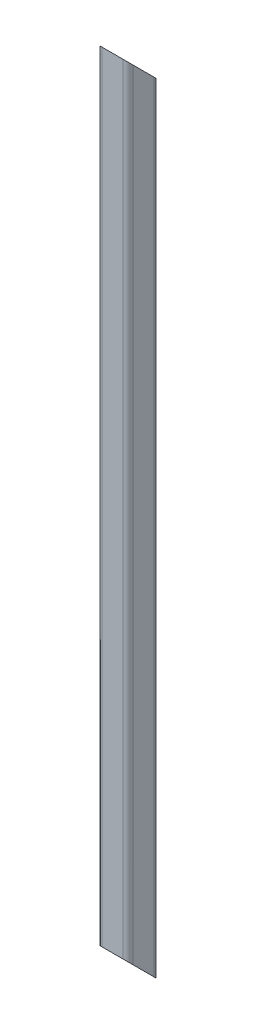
ISO-10303-21;
HEADER;
FILE_DESCRIPTION(('STEP AP214'),'2;1');
FILE_NAME('part.step','',(''),(''),'','','');
FILE_SCHEMA(('AUTOMOTIVE_DESIGN { 1 0 10303 214 1 1 1 1 }'));
ENDSEC;
DATA;
#1=APPLICATION_CONTEXT('core data for automotive mechanical design processes');
#2=APPLICATION_PROTOCOL_DEFINITION('international standard','automotive_design',2000,#1);
#3=PRODUCT_CONTEXT('',#1,'mechanical');
#4=PRODUCT('Part','Part','',(#3));
#5=PRODUCT_RELATED_PRODUCT_CATEGORY('part','',(#4));
#6=PRODUCT_DEFINITION_FORMATION('','',#4);
#7=PRODUCT_DEFINITION_CONTEXT('part definition',#1,'design');
#8=PRODUCT_DEFINITION('design','',#6,#7);
#9=PRODUCT_DEFINITION_SHAPE('','',#8);
#10=(LENGTH_UNIT() NAMED_UNIT(*) SI_UNIT(.MILLI.,.METRE.));
#11=(NAMED_UNIT(*) PLANE_ANGLE_UNIT() SI_UNIT($,.RADIAN.));
#12=(NAMED_UNIT(*) SI_UNIT($,.STERADIAN.) SOLID_ANGLE_UNIT());
#13=UNCERTAINTY_MEASURE_WITH_UNIT(LENGTH_MEASURE(1.E-05),#10,'distance_accuracy_value','');
#14=(GEOMETRIC_REPRESENTATION_CONTEXT(3) GLOBAL_UNCERTAINTY_ASSIGNED_CONTEXT((#13)) GLOBAL_UNIT_ASSIGNED_CONTEXT((#10,
#11,#12)) REPRESENTATION_CONTEXT('',''));
#15=CARTESIAN_POINT('',(0.,0.,0.));
#16=DIRECTION('',(0.,0.,1.));
#17=DIRECTION('',(1.,0.,0.));
#18=AXIS2_PLACEMENT_3D('',#15,#16,#17);
#19=CARTESIAN_POINT('',(-12.9743200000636,1003.30000000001,-12.9743199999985));
#20=DIRECTION('',(0.,-1.00000000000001,0.));
#21=DIRECTION('',(0.,0.,-1.));
#22=AXIS2_PLACEMENT_3D('',#19,#20,#21);
#23=CYLINDRICAL_SURFACE('',#22,6.07568);
#24=DIRECTION('',(0.,-1.00000000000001,0.));
#25=VECTOR('',#24,1.);
#26=CARTESIAN_POINT('',(-12.9743200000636,1003.30000000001,-19.049999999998));
#27=LINE('',#26,#25);
#28=CARTESIAN_POINT('',(-12.9743200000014,965.200000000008,-19.0499999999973));
#29=VERTEX_POINT('',#28);
#30=CARTESIAN_POINT('',(-12.9743199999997,-2.77555756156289E-13,-19.0499999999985));
#31=VERTEX_POINT('',#30);
#32=EDGE_CURVE('E219',#29,#31,#27,.T.);
#33=ORIENTED_EDGE('',*,*,#32,.T.);
#34=CARTESIAN_POINT('',(-12.9743199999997,6.07568000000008,-12.974319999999));
#35=DIRECTION('',(0.,0.707106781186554,-0.707106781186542));
#36=DIRECTION('',(0.,-0.707106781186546,-0.707106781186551));
#37=AXIS2_PLACEMENT_3D('',#34,#35,#36);
#38=ELLIPSE('',#37,8.59230905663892,6.07568);
#39=CARTESIAN_POINT('',(-19.05,6.07567999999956,-12.9743199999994));
#40=VERTEX_POINT('',#39);
#41=EDGE_CURVE('E286',#31,#40,#38,.T.);
#42=ORIENTED_EDGE('',*,*,#41,.T.);
#43=DIRECTION('',(0.,-1.00000000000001,0.));
#44=VECTOR('',#43,1.);
#45=CARTESIAN_POINT('',(-19.050000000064,1003.30000000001,-12.9743199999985));
#46=LINE('',#45,#44);
#47=CARTESIAN_POINT('',(-19.05,971.275680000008,-12.9743199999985));
#48=VERTEX_POINT('',#47);
#49=EDGE_CURVE('E231',#48,#40,#46,.T.);
#50=ORIENTED_EDGE('',*,*,#49,.F.);
#51=CARTESIAN_POINT('',(-12.9743200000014,971.275680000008,-12.9743199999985));
#52=DIRECTION('',(0.,-0.707106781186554,0.707106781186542));
#53=DIRECTION('',(0.,-0.707106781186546,-0.707106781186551));
#54=AXIS2_PLACEMENT_3D('',#51,#52,#53);
#55=ELLIPSE('',#54,8.59230905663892,6.07568);
#56=EDGE_CURVE('E260',#48,#29,#55,.T.);
#57=ORIENTED_EDGE('',*,*,#56,.T.);
#58=EDGE_LOOP('',(#33,#42,#50,#57));
#59=FACE_BOUND('',#58,.T.);
#60=ADVANCED_FACE('F80',(#59),#23,.T.);
#61=CARTESIAN_POINT('',(-19.050000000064,1003.30000000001,-12.9743199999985));
#62=DIRECTION('',(1.,0.,0.));
#63=DIRECTION('',(0.,0.,-1.));
#64=AXIS2_PLACEMENT_3D('',#61,#62,#63);
#65=PLANE('',#64);
#66=ORIENTED_EDGE('',*,*,#49,.T.);
#67=DIRECTION('',(0.,0.707106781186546,0.707106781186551));
#68=VECTOR('',#67,1.);
#69=CARTESIAN_POINT('',(-19.05,1.94289029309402E-13,-19.0499999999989));
#70=LINE('',#69,#68);
#71=CARTESIAN_POINT('',(-19.05,32.0243200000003,12.9743200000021));
#72=VERTEX_POINT('',#71);
#73=EDGE_CURVE('E212',#40,#72,#70,.T.);
#74=ORIENTED_EDGE('',*,*,#73,.T.);
#75=DIRECTION('',(0.,-1.00000000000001,0.));
#76=VECTOR('',#75,1.);
#77=CARTESIAN_POINT('',(-19.050000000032,1003.30000000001,12.9743200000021));
#78=LINE('',#77,#76);
#79=CARTESIAN_POINT('',(-19.050000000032,997.224320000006,12.9743200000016));
#80=VERTEX_POINT('',#79);
#81=EDGE_CURVE('E228',#80,#72,#78,.T.);
#82=ORIENTED_EDGE('',*,*,#81,.F.);
#83=DIRECTION('',(0.,-0.707106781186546,-0.707106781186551));
#84=VECTOR('',#83,1.);
#85=CARTESIAN_POINT('',(-19.050000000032,1003.30000000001,19.0500000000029));
#86=LINE('',#85,#84);
#87=EDGE_CURVE('E289',#80,#48,#86,.T.);
#88=ORIENTED_EDGE('',*,*,#87,.T.);
#89=EDGE_LOOP('',(#66,#74,#82,#88));
#90=FACE_BOUND('',#89,.T.);
#91=ADVANCED_FACE('F320',(#90),#65,.F.);
#92=CARTESIAN_POINT('',(-12.9743200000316,1003.30000000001,12.9743200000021));
#93=DIRECTION('',(0.,-1.00000000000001,0.));
#94=DIRECTION('',(0.,0.,-1.));
#95=AXIS2_PLACEMENT_3D('',#92,#93,#94);
#96=CYLINDRICAL_SURFACE('',#95,6.07568);
#97=ORIENTED_EDGE('',*,*,#81,.T.);
#98=CARTESIAN_POINT('',(-12.9743199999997,32.0243200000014,12.9743200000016));
#99=DIRECTION('',(0.,0.707106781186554,-0.707106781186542));
#100=DIRECTION('',(0.,-0.707106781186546,-0.707106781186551));
#101=AXIS2_PLACEMENT_3D('',#98,#99,#100);
#102=ELLIPSE('',#101,8.59230905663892,6.07568);
#103=CARTESIAN_POINT('',(-12.9743199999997,38.1000000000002,19.050000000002));
#104=VERTEX_POINT('',#103);
#105=EDGE_CURVE('E339',#72,#104,#102,.T.);
#106=ORIENTED_EDGE('',*,*,#105,.T.);
#107=DIRECTION('',(0.,-1.00000000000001,0.));
#108=VECTOR('',#107,1.);
#109=CARTESIAN_POINT('',(-12.9743200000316,1003.30000000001,19.0500000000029));
#110=LINE('',#109,#108);
#111=CARTESIAN_POINT('',(-12.9743200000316,1003.30000000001,19.0500000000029));
#112=VERTEX_POINT('',#111);
#113=EDGE_CURVE('E225',#112,#104,#110,.T.);
#114=ORIENTED_EDGE('',*,*,#113,.F.);
#115=CARTESIAN_POINT('',(-12.9743200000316,997.224320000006,12.9743200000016));
#116=DIRECTION('',(0.,-0.707106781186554,0.707106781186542));
#117=DIRECTION('',(0.,-0.707106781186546,-0.707106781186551));
#118=AXIS2_PLACEMENT_3D('',#115,#116,#117);
#119=ELLIPSE('',#118,8.59230905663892,6.07568);
#120=EDGE_CURVE('E310',#112,#80,#119,.T.);
#121=ORIENTED_EDGE('',*,*,#120,.T.);
#122=EDGE_LOOP('',(#97,#106,#114,#121));
#123=FACE_BOUND('',#122,.T.);
#124=ADVANCED_FACE('F315',(#123),#96,.T.);
#125=CARTESIAN_POINT('',(-12.9743200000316,1003.30000000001,19.0500000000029));
#126=DIRECTION('',(0.,0.,-1.));
#127=DIRECTION('',(-1.,0.,0.));
#128=AXIS2_PLACEMENT_3D('',#125,#126,#127);
#129=PLANE('',#128);
#130=ORIENTED_EDGE('',*,*,#113,.T.);
#131=DIRECTION('',(1.,0.,0.));
#132=VECTOR('',#131,1.);
#133=CARTESIAN_POINT('',(-19.05,38.1000000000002,19.050000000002));
#134=LINE('',#133,#132);
#135=CARTESIAN_POINT('',(12.9743199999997,38.1000000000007,19.0499999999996));
#136=VERTEX_POINT('',#135);
#137=EDGE_CURVE('E321',#104,#136,#134,.T.);
#138=ORIENTED_EDGE('',*,*,#137,.T.);
#139=DIRECTION('',(0.,-1.00000000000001,0.));
#140=VECTOR('',#139,1.);
#141=CARTESIAN_POINT('',(12.9743199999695,1003.30000000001,19.0500000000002));
#142=LINE('',#141,#140);
#143=CARTESIAN_POINT('',(12.9743199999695,1003.30000000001,19.0500000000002));
#144=VERTEX_POINT('',#143);
#145=EDGE_CURVE('E217',#144,#136,#142,.T.);
#146=ORIENTED_EDGE('',*,*,#145,.F.);
#147=DIRECTION('',(1.,0.,0.));
#148=VECTOR('',#147,1.);
#149=CARTESIAN_POINT('',(-12.9743200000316,1003.30000000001,19.0500000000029));
#150=LINE('',#149,#148);
#151=EDGE_CURVE('E278',#112,#144,#150,.T.);
#152=ORIENTED_EDGE('',*,*,#151,.F.);
#153=EDGE_LOOP('',(#130,#138,#146,#152));
#154=FACE_BOUND('',#153,.T.);
#155=ADVANCED_FACE('F345',(#154),#129,.F.);
#156=CARTESIAN_POINT('',(12.9743199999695,1003.30000000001,12.9743200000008));
#157=DIRECTION('',(0.,-1.00000000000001,0.));
#158=DIRECTION('',(0.,0.,-1.));
#159=AXIS2_PLACEMENT_3D('',#156,#157,#158);
#160=CYLINDRICAL_SURFACE('',#159,6.07568);
#161=ORIENTED_EDGE('',*,*,#145,.T.);
#162=CARTESIAN_POINT('',(12.9743199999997,32.0243199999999,12.9743199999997));
#163=DIRECTION('',(0.,0.707106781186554,-0.707106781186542));
#164=DIRECTION('',(0.,-0.707106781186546,-0.707106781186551));
#165=AXIS2_PLACEMENT_3D('',#162,#163,#164);
#166=ELLIPSE('',#165,8.59230905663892,6.07568);
#167=CARTESIAN_POINT('',(19.05,32.0243200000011,12.9743199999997));
#168=VERTEX_POINT('',#167);
#169=EDGE_CURVE('E201',#136,#168,#166,.T.);
#170=ORIENTED_EDGE('',*,*,#169,.T.);
#171=DIRECTION('',(0.,-1.00000000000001,0.));
#172=VECTOR('',#171,1.);
#173=CARTESIAN_POINT('',(19.049999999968,1003.30000000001,12.9743200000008));
#174=LINE('',#173,#172);
#175=CARTESIAN_POINT('',(19.049999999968,997.224320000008,12.9743200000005));
#176=VERTEX_POINT('',#175);
#177=EDGE_CURVE('E211',#176,#168,#174,.T.);
#178=ORIENTED_EDGE('',*,*,#177,.F.);
#179=CARTESIAN_POINT('',(12.9743199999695,997.224320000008,12.9743200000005));
#180=DIRECTION('',(0.,-0.707106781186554,0.707106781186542));
#181=DIRECTION('',(0.,-0.707106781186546,-0.707106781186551));
#182=AXIS2_PLACEMENT_3D('',#179,#180,#181);
#183=ELLIPSE('',#182,8.59230905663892,6.07568);
#184=EDGE_CURVE('E307',#176,#144,#183,.T.);
#185=ORIENTED_EDGE('',*,*,#184,.T.);
#186=EDGE_LOOP('',(#161,#170,#178,#185));
#187=FACE_BOUND('',#186,.T.);
#188=ADVANCED_FACE('F342',(#187),#160,.T.);
#189=CARTESIAN_POINT('',(19.0499999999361,1003.30000000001,-12.9743199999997));
#190=DIRECTION('',(-1.,0.,0.));
#191=DIRECTION('',(0.,0.,1.));
#192=AXIS2_PLACEMENT_3D('',#189,#190,#191);
#193=PLANE('',#192);
#194=ORIENTED_EDGE('',*,*,#177,.T.);
#195=DIRECTION('',(0.,0.707106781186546,0.707106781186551));
#196=VECTOR('',#195,1.);
#197=CARTESIAN_POINT('',(19.05,0.,-19.0500000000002));
#198=LINE('',#197,#196);
#199=CARTESIAN_POINT('',(19.05,6.07568000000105,-12.9743200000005));
#200=VERTEX_POINT('',#199);
#201=EDGE_CURVE('E193',#200,#168,#198,.T.);
#202=ORIENTED_EDGE('',*,*,#201,.F.);
#203=DIRECTION('',(0.,-1.00000000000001,0.));
#204=VECTOR('',#203,1.);
#205=CARTESIAN_POINT('',(19.0499999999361,1003.30000000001,-12.9743199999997));
#206=LINE('',#205,#204);
#207=CARTESIAN_POINT('',(19.05,971.275680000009,-12.9743199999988));
#208=VERTEX_POINT('',#207);
#209=EDGE_CURVE('E209',#208,#200,#206,.T.);
#210=ORIENTED_EDGE('',*,*,#209,.F.);
#211=DIRECTION('',(0.,-0.707106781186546,-0.707106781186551));
#212=VECTOR('',#211,1.);
#213=CARTESIAN_POINT('',(19.049999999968,1003.30000000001,19.0500000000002));
#214=LINE('',#213,#212);
#215=EDGE_CURVE('E292',#176,#208,#214,.T.);
#216=ORIENTED_EDGE('',*,*,#215,.F.);
#217=EDGE_LOOP('',(#194,#202,#210,#216));
#218=FACE_BOUND('',#217,.T.);
#219=ADVANCED_FACE('F207',(#218),#193,.F.);
#220=CARTESIAN_POINT('',(12.9743199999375,1003.30000000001,-12.9743199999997));
#221=DIRECTION('',(0.,-1.00000000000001,0.));
#222=DIRECTION('',(0.,0.,-1.));
#223=AXIS2_PLACEMENT_3D('',#220,#221,#222);
#224=CYLINDRICAL_SURFACE('',#223,6.07568);
#225=ORIENTED_EDGE('',*,*,#209,.T.);
#226=CARTESIAN_POINT('',(12.9743199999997,6.07568000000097,-12.974320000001));
#227=DIRECTION('',(0.,0.707106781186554,-0.707106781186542));
#228=DIRECTION('',(0.,-0.707106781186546,-0.707106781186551));
#229=AXIS2_PLACEMENT_3D('',#226,#227,#228);
#230=ELLIPSE('',#229,8.59230905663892,6.07568);
#231=CARTESIAN_POINT('',(12.9743199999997,0.,-19.0500000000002));
#232=VERTEX_POINT('',#231);
#233=EDGE_CURVE('E190',#200,#232,#230,.T.);
#234=ORIENTED_EDGE('',*,*,#233,.T.);
#235=DIRECTION('',(0.,-1.00000000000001,0.));
#236=VECTOR('',#235,1.);
#237=CARTESIAN_POINT('',(12.9743199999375,1003.30000000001,-19.0500000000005));
#238=LINE('',#237,#236);
#239=CARTESIAN_POINT('',(12.9743199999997,965.200000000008,-19.05));
#240=VERTEX_POINT('',#239);
#241=EDGE_CURVE('E215',#240,#232,#238,.T.);
#242=ORIENTED_EDGE('',*,*,#241,.F.);
#243=CARTESIAN_POINT('',(12.9743199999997,971.275680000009,-12.9743199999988));
#244=DIRECTION('',(0.,-0.707106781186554,0.707106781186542));
#245=DIRECTION('',(0.,-0.707106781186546,-0.707106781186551));
#246=AXIS2_PLACEMENT_3D('',#243,#244,#245);
#247=ELLIPSE('',#246,8.59230905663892,6.07568);
#248=EDGE_CURVE('E101',#240,#208,#247,.T.);
#249=ORIENTED_EDGE('',*,*,#248,.T.);
#250=EDGE_LOOP('',(#225,#234,#242,#249));
#251=FACE_BOUND('',#250,.T.);
#252=ADVANCED_FACE('F214',(#251),#224,.T.);
#253=CARTESIAN_POINT('',(-12.9743200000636,1003.30000000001,-19.049999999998));
#254=DIRECTION('',(0.,0.,1.));
#255=DIRECTION('',(1.,0.,0.));
#256=AXIS2_PLACEMENT_3D('',#253,#254,#255);
#257=PLANE('',#256);
#258=ORIENTED_EDGE('',*,*,#32,.F.);
#259=DIRECTION('',(1.,0.,0.));
#260=VECTOR('',#259,1.);
#261=CARTESIAN_POINT('',(-19.05,965.200000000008,-19.0499999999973));
#262=LINE('',#261,#260);
#263=EDGE_CURVE('E253',#29,#240,#262,.T.);
#264=ORIENTED_EDGE('',*,*,#263,.T.);
#265=ORIENTED_EDGE('',*,*,#241,.T.);
#266=DIRECTION('',(-1.,0.,0.));
#267=VECTOR('',#266,1.);
#268=CARTESIAN_POINT('',(-12.9743199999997,-2.77555756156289E-13,-19.0499999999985));
#269=LINE('',#268,#267);
#270=EDGE_CURVE('E196',#232,#31,#269,.T.);
#271=ORIENTED_EDGE('',*,*,#270,.T.);
#272=EDGE_LOOP('',(#258,#264,#265,#271));
#273=FACE_BOUND('',#272,.T.);
#274=ADVANCED_FACE('F288',(#273),#257,.F.);
#275=CARTESIAN_POINT('',(-12.9743200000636,1003.30000000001,-12.9743199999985));
#276=DIRECTION('',(0.,-1.00000000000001,0.));
#277=DIRECTION('',(0.,0.,-1.));
#278=AXIS2_PLACEMENT_3D('',#275,#276,#277);
#279=CYLINDRICAL_SURFACE('',#278,3.03784);
#280=CARTESIAN_POINT('',(-12.9743199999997,6.07568000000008,-12.974319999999));
#281=DIRECTION('',(0.,0.707106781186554,-0.707106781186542));
#282=DIRECTION('',(0.,-0.707106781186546,-0.707106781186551));
#283=AXIS2_PLACEMENT_3D('',#280,#281,#282);
#284=ELLIPSE('',#283,4.29615452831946,3.03784);
#285=CARTESIAN_POINT('',(-12.9743199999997,3.0378399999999,-16.0121599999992));
#286=VERTEX_POINT('',#285);
#287=CARTESIAN_POINT('',(-16.0121600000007,6.07568000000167,-12.974319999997));
#288=VERTEX_POINT('',#287);
#289=EDGE_CURVE('E202',#286,#288,#284,.T.);
#290=ORIENTED_EDGE('',*,*,#289,.F.);
#291=DIRECTION('',(0.,-1.00000000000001,0.));
#292=VECTOR('',#291,1.);
#293=CARTESIAN_POINT('',(-12.9743200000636,1003.30000000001,-16.0121599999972));
#294=LINE('',#293,#292);
#295=CARTESIAN_POINT('',(-12.9743200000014,968.237840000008,-16.0121600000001));
#296=VERTEX_POINT('',#295);
#297=EDGE_CURVE('E256',#296,#286,#294,.T.);
#298=ORIENTED_EDGE('',*,*,#297,.F.);
#299=CARTESIAN_POINT('',(-12.9743200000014,971.275680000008,-12.9743199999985));
#300=DIRECTION('',(0.,-0.707106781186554,0.707106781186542));
#301=DIRECTION('',(0.,-0.707106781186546,-0.707106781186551));
#302=AXIS2_PLACEMENT_3D('',#299,#300,#301);
#303=ELLIPSE('',#302,4.29615452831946,3.03784);
#304=CARTESIAN_POINT('',(-16.0121600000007,971.275680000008,-12.9743199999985));
#305=VERTEX_POINT('',#304);
#306=EDGE_CURVE('E240',#305,#296,#303,.T.);
#307=ORIENTED_EDGE('',*,*,#306,.F.);
#308=DIRECTION('',(0.,-1.00000000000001,0.));
#309=VECTOR('',#308,1.);
#310=CARTESIAN_POINT('',(-16.0121600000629,1003.30000000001,-12.9743199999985));
#311=LINE('',#310,#309);
#312=EDGE_CURVE('E275',#305,#288,#311,.T.);
#313=ORIENTED_EDGE('',*,*,#312,.T.);
#314=EDGE_LOOP('',(#290,#298,#307,#313));
#315=FACE_BOUND('',#314,.T.);
#316=ADVANCED_FACE('F399',(#315),#279,.F.);
#317=CARTESIAN_POINT('',(-16.0121600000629,1003.30000000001,-12.9743199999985));
#318=DIRECTION('',(1.,0.,0.));
#319=DIRECTION('',(0.,0.,-1.));
#320=AXIS2_PLACEMENT_3D('',#317,#318,#319);
#321=PLANE('',#320);
#322=DIRECTION('',(0.,0.707106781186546,0.707106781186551));
#323=VECTOR('',#322,1.);
#324=CARTESIAN_POINT('',(-16.0121600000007,504.687839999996,485.637840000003));
#325=LINE('',#324,#323);
#326=CARTESIAN_POINT('',(-16.0121600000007,32.0243200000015,12.9743200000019));
#327=VERTEX_POINT('',#326);
#328=EDGE_CURVE('E335',#288,#327,#325,.T.);
#329=ORIENTED_EDGE('',*,*,#328,.F.);
#330=ORIENTED_EDGE('',*,*,#312,.F.);
#331=DIRECTION('',(0.,-0.707106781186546,-0.707106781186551));
#332=VECTOR('',#331,1.);
#333=CARTESIAN_POINT('',(-16.0121600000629,987.287840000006,3.0378400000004));
#334=LINE('',#333,#332);
#335=CARTESIAN_POINT('',(-16.0121600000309,997.224320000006,12.9743200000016));
#336=VERTEX_POINT('',#335);
#337=EDGE_CURVE('E303',#336,#305,#334,.T.);
#338=ORIENTED_EDGE('',*,*,#337,.F.);
#339=DIRECTION('',(0.,-1.00000000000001,0.));
#340=VECTOR('',#339,1.);
#341=CARTESIAN_POINT('',(-16.0121600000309,1003.30000000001,12.9743200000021));
#342=LINE('',#341,#340);
#343=EDGE_CURVE('E272',#336,#327,#342,.T.);
#344=ORIENTED_EDGE('',*,*,#343,.T.);
#345=EDGE_LOOP('',(#329,#330,#338,#344));
#346=FACE_BOUND('',#345,.T.);
#347=ADVANCED_FACE('F408',(#346),#321,.T.);
#348=CARTESIAN_POINT('',(-12.9743200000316,1003.30000000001,12.9743200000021));
#349=DIRECTION('',(0.,-1.00000000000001,0.));
#350=DIRECTION('',(0.,0.,-1.));
#351=AXIS2_PLACEMENT_3D('',#348,#349,#350);
#352=CYLINDRICAL_SURFACE('',#351,3.03784);
#353=CARTESIAN_POINT('',(-12.9743199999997,32.0243200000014,12.9743200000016));
#354=DIRECTION('',(0.,0.707106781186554,-0.707106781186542));
#355=DIRECTION('',(0.,-0.707106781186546,-0.707106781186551));
#356=AXIS2_PLACEMENT_3D('',#353,#354,#355);
#357=ELLIPSE('',#356,4.29615452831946,3.03784);
#358=CARTESIAN_POINT('',(-12.9743199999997,35.062160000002,16.0121600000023));
#359=VERTEX_POINT('',#358);
#360=EDGE_CURVE('E333',#327,#359,#357,.T.);
#361=ORIENTED_EDGE('',*,*,#360,.F.);
#362=ORIENTED_EDGE('',*,*,#343,.F.);
#363=CARTESIAN_POINT('',(-12.9743200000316,997.224320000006,12.9743200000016));
#364=DIRECTION('',(0.,-0.707106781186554,0.707106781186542));
#365=DIRECTION('',(0.,-0.707106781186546,-0.707106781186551));
#366=AXIS2_PLACEMENT_3D('',#363,#364,#365);
#367=ELLIPSE('',#366,4.29615452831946,3.03784);
#368=CARTESIAN_POINT('',(-12.9743200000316,1000.26216,16.0121600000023));
#369=VERTEX_POINT('',#368);
#370=EDGE_CURVE('E301',#369,#336,#367,.T.);
#371=ORIENTED_EDGE('',*,*,#370,.F.);
#372=DIRECTION('',(0.,-1.00000000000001,0.));
#373=VECTOR('',#372,1.);
#374=CARTESIAN_POINT('',(-12.9743200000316,1003.3,16.0121600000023));
#375=LINE('',#374,#373);
#376=EDGE_CURVE('E269',#369,#359,#375,.T.);
#377=ORIENTED_EDGE('',*,*,#376,.T.);
#378=EDGE_LOOP('',(#361,#362,#371,#377));
#379=FACE_BOUND('',#378,.T.);
#380=ADVANCED_FACE('F418',(#379),#352,.F.);
#381=CARTESIAN_POINT('',(-12.9743200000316,1003.3,16.0121600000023));
#382=DIRECTION('',(0.,0.,-1.));
#383=DIRECTION('',(-1.,0.,0.));
#384=AXIS2_PLACEMENT_3D('',#381,#382,#383);
#385=PLANE('',#384);
#386=DIRECTION('',(1.,0.,0.));
#387=VECTOR('',#386,1.);
#388=CARTESIAN_POINT('',(-12.9743199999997,35.062160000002,16.0121600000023));
#389=LINE('',#388,#387);
#390=CARTESIAN_POINT('',(12.9743199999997,35.0621600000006,16.0121599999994));
#391=VERTEX_POINT('',#390);
#392=EDGE_CURVE('E331',#359,#391,#389,.T.);
#393=ORIENTED_EDGE('',*,*,#392,.F.);
#394=ORIENTED_EDGE('',*,*,#376,.F.);
#395=DIRECTION('',(-1.,0.,0.));
#396=VECTOR('',#395,1.);
#397=CARTESIAN_POINT('',(-12.9743200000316,1000.26216,16.0121600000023));
#398=LINE('',#397,#396);
#399=CARTESIAN_POINT('',(12.9743199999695,1000.26216000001,16.0121599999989));
#400=VERTEX_POINT('',#399);
#401=EDGE_CURVE('E299',#400,#369,#398,.T.);
#402=ORIENTED_EDGE('',*,*,#401,.F.);
#403=DIRECTION('',(0.,-1.00000000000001,0.));
#404=VECTOR('',#403,1.);
#405=CARTESIAN_POINT('',(12.9743199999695,1003.30000000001,16.0121600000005));
#406=LINE('',#405,#404);
#407=EDGE_CURVE('E266',#400,#391,#406,.T.);
#408=ORIENTED_EDGE('',*,*,#407,.T.);
#409=EDGE_LOOP('',(#393,#394,#402,#408));
#410=FACE_BOUND('',#409,.T.);
#411=ADVANCED_FACE('F428',(#410),#385,.T.);
#412=CARTESIAN_POINT('',(12.9743199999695,1003.30000000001,12.9743200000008));
#413=DIRECTION('',(0.,-1.00000000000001,0.));
#414=DIRECTION('',(0.,0.,-1.));
#415=AXIS2_PLACEMENT_3D('',#412,#413,#414);
#416=CYLINDRICAL_SURFACE('',#415,3.03784);
#417=CARTESIAN_POINT('',(12.9743199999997,32.0243199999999,12.9743199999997));
#418=DIRECTION('',(0.,0.707106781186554,-0.707106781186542));
#419=DIRECTION('',(0.,-0.707106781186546,-0.707106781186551));
#420=AXIS2_PLACEMENT_3D('',#417,#418,#419);
#421=ELLIPSE('',#420,4.29615452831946,3.03784);
#422=CARTESIAN_POINT('',(16.0121599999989,32.0243200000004,12.9743200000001));
#423=VERTEX_POINT('',#422);
#424=EDGE_CURVE('E329',#391,#423,#421,.T.);
#425=ORIENTED_EDGE('',*,*,#424,.F.);
#426=ORIENTED_EDGE('',*,*,#407,.F.);
#427=CARTESIAN_POINT('',(12.9743199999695,997.224320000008,12.9743200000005));
#428=DIRECTION('',(0.,-0.707106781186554,0.707106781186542));
#429=DIRECTION('',(0.,-0.707106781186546,-0.707106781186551));
#430=AXIS2_PLACEMENT_3D('',#427,#428,#429);
#431=ELLIPSE('',#430,4.29615452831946,3.03784);
#432=CARTESIAN_POINT('',(16.0121599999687,997.224320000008,12.9743200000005));
#433=VERTEX_POINT('',#432);
#434=EDGE_CURVE('E297',#433,#400,#431,.T.);
#435=ORIENTED_EDGE('',*,*,#434,.F.);
#436=DIRECTION('',(0.,-1.00000000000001,0.));
#437=VECTOR('',#436,1.);
#438=CARTESIAN_POINT('',(16.0121599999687,1003.30000000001,12.9743200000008));
#439=LINE('',#438,#437);
#440=EDGE_CURVE('E258',#433,#423,#439,.T.);
#441=ORIENTED_EDGE('',*,*,#440,.T.);
#442=EDGE_LOOP('',(#425,#426,#435,#441));
#443=FACE_BOUND('',#442,.T.);
#444=ADVANCED_FACE('F438',(#443),#416,.F.);
#445=CARTESIAN_POINT('',(16.0121599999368,1003.30000000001,-12.9743199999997));
#446=DIRECTION('',(-1.,0.,0.));
#447=DIRECTION('',(0.,0.,1.));
#448=AXIS2_PLACEMENT_3D('',#445,#446,#447);
#449=PLANE('',#448);
#450=DIRECTION('',(0.,-0.707106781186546,-0.707106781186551));
#451=VECTOR('',#450,1.);
#452=CARTESIAN_POINT('',(16.0121599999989,504.687839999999,485.637840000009));
#453=LINE('',#452,#451);
#454=CARTESIAN_POINT('',(16.0121600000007,6.0756800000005,-12.9743200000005));
#455=VERTEX_POINT('',#454);
#456=EDGE_CURVE('E327',#423,#455,#453,.T.);
#457=ORIENTED_EDGE('',*,*,#456,.F.);
#458=ORIENTED_EDGE('',*,*,#440,.F.);
#459=DIRECTION('',(0.,0.707106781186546,0.707106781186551));
#460=VECTOR('',#459,1.);
#461=CARTESIAN_POINT('',(16.0121599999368,987.287840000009,3.03784000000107));
#462=LINE('',#461,#460);
#463=CARTESIAN_POINT('',(16.0121599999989,971.275680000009,-12.9743199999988));
#464=VERTEX_POINT('',#463);
#465=EDGE_CURVE('E252',#464,#433,#462,.T.);
#466=ORIENTED_EDGE('',*,*,#465,.F.);
#467=DIRECTION('',(0.,-1.00000000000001,0.));
#468=VECTOR('',#467,1.);
#469=CARTESIAN_POINT('',(16.0121599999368,1003.30000000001,-12.9743199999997));
#470=LINE('',#469,#468);
#471=EDGE_CURVE('E251',#464,#455,#470,.T.);
#472=ORIENTED_EDGE('',*,*,#471,.T.);
#473=EDGE_LOOP('',(#457,#458,#466,#472));
#474=FACE_BOUND('',#473,.T.);
#475=ADVANCED_FACE('F448',(#474),#449,.T.);
#476=CARTESIAN_POINT('',(12.9743199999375,1003.30000000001,-12.9743199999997));
#477=DIRECTION('',(0.,-1.00000000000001,0.));
#478=DIRECTION('',(0.,0.,-1.));
#479=AXIS2_PLACEMENT_3D('',#476,#477,#478);
#480=CYLINDRICAL_SURFACE('',#479,3.03784);
#481=CARTESIAN_POINT('',(12.9743199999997,6.07568000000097,-12.974320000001));
#482=DIRECTION('',(0.,0.707106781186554,-0.707106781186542));
#483=DIRECTION('',(0.,-0.707106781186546,-0.707106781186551));
#484=AXIS2_PLACEMENT_3D('',#481,#482,#483);
#485=ELLIPSE('',#484,4.29615452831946,3.03784);
#486=CARTESIAN_POINT('',(12.9743199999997,3.03783999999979,-16.0121599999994));
#487=VERTEX_POINT('',#486);
#488=EDGE_CURVE('E93',#455,#487,#485,.T.);
#489=ORIENTED_EDGE('',*,*,#488,.F.);
#490=ORIENTED_EDGE('',*,*,#471,.F.);
#491=CARTESIAN_POINT('',(12.9743199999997,971.275680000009,-12.9743199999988));
#492=DIRECTION('',(0.,-0.707106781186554,0.707106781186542));
#493=DIRECTION('',(0.,-0.707106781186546,-0.707106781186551));
#494=AXIS2_PLACEMENT_3D('',#491,#492,#493);
#495=ELLIPSE('',#494,4.29615452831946,3.03784);
#496=CARTESIAN_POINT('',(12.9743199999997,968.237840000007,-16.0121600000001));
#497=VERTEX_POINT('',#496);
#498=EDGE_CURVE('E237',#497,#464,#495,.T.);
#499=ORIENTED_EDGE('',*,*,#498,.F.);
#500=DIRECTION('',(0.,-1.00000000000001,0.));
#501=VECTOR('',#500,1.);
#502=CARTESIAN_POINT('',(12.9743199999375,1003.30000000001,-16.0121600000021));
#503=LINE('',#502,#501);
#504=EDGE_CURVE('E249',#497,#487,#503,.T.);
#505=ORIENTED_EDGE('',*,*,#504,.T.);
#506=EDGE_LOOP('',(#489,#490,#499,#505));
#507=FACE_BOUND('',#506,.T.);
#508=ADVANCED_FACE('F248',(#507),#480,.F.);
#509=CARTESIAN_POINT('',(-12.9743200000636,1003.30000000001,-16.0121599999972));
#510=DIRECTION('',(0.,0.,1.));
#511=DIRECTION('',(1.,0.,0.));
#512=AXIS2_PLACEMENT_3D('',#509,#510,#511);
#513=PLANE('',#512);
#514=DIRECTION('',(-1.,0.,0.));
#515=VECTOR('',#514,1.);
#516=CARTESIAN_POINT('',(-12.9743199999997,3.0378399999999,-16.0121599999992));
#517=LINE('',#516,#515);
#518=EDGE_CURVE('E12',#487,#286,#517,.T.);
#519=ORIENTED_EDGE('',*,*,#518,.F.);
#520=ORIENTED_EDGE('',*,*,#504,.F.);
#521=DIRECTION('',(1.,0.,0.));
#522=VECTOR('',#521,1.);
#523=CARTESIAN_POINT('',(-12.9743200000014,968.237840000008,-16.0121600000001));
#524=LINE('',#523,#522);
#525=EDGE_CURVE('E87',#296,#497,#524,.T.);
#526=ORIENTED_EDGE('',*,*,#525,.F.);
#527=ORIENTED_EDGE('',*,*,#297,.T.);
#528=EDGE_LOOP('',(#519,#520,#526,#527));
#529=FACE_BOUND('',#528,.T.);
#530=ADVANCED_FACE('F255',(#529),#513,.T.);
#531=CARTESIAN_POINT('',(-19.050000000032,1003.30000000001,19.0500000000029));
#532=DIRECTION('',(0.,-0.707106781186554,0.707106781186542));
#533=DIRECTION('',(0.,-0.707106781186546,-0.707106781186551));
#534=AXIS2_PLACEMENT_3D('',#531,#532,#533);
#535=PLANE('',#534);
#536=ORIENTED_EDGE('',*,*,#306,.T.);
#537=ORIENTED_EDGE('',*,*,#525,.T.);
#538=ORIENTED_EDGE('',*,*,#498,.T.);
#539=ORIENTED_EDGE('',*,*,#465,.T.);
#540=ORIENTED_EDGE('',*,*,#434,.T.);
#541=ORIENTED_EDGE('',*,*,#401,.T.);
#542=ORIENTED_EDGE('',*,*,#370,.T.);
#543=ORIENTED_EDGE('',*,*,#337,.T.);
#544=EDGE_LOOP('',(#536,#537,#538,#539,#540,#541,#542,#543));
#545=FACE_BOUND('',#544,.T.);
#546=ORIENTED_EDGE('',*,*,#87,.F.);
#547=ORIENTED_EDGE('',*,*,#120,.F.);
#548=ORIENTED_EDGE('',*,*,#151,.T.);
#549=ORIENTED_EDGE('',*,*,#184,.F.);
#550=ORIENTED_EDGE('',*,*,#215,.T.);
#551=ORIENTED_EDGE('',*,*,#248,.F.);
#552=ORIENTED_EDGE('',*,*,#263,.F.);
#553=ORIENTED_EDGE('',*,*,#56,.F.);
#554=EDGE_LOOP('',(#546,#547,#548,#549,#550,#551,#552,#553));
#555=FACE_BOUND('',#554,.T.);
#556=ADVANCED_FACE('F236',(#545,#555),#535,.F.);
#557=CARTESIAN_POINT('',(-19.05,1.94289029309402E-13,-19.0499999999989));
#558=DIRECTION('',(0.,0.707106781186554,-0.707106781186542));
#559=DIRECTION('',(0.,0.707106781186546,0.707106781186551));
#560=AXIS2_PLACEMENT_3D('',#557,#558,#559);
#561=PLANE('',#560);
#562=ORIENTED_EDGE('',*,*,#289,.T.);
#563=ORIENTED_EDGE('',*,*,#328,.T.);
#564=ORIENTED_EDGE('',*,*,#360,.T.);
#565=ORIENTED_EDGE('',*,*,#392,.T.);
#566=ORIENTED_EDGE('',*,*,#424,.T.);
#567=ORIENTED_EDGE('',*,*,#456,.T.);
#568=ORIENTED_EDGE('',*,*,#488,.T.);
#569=ORIENTED_EDGE('',*,*,#518,.T.);
#570=EDGE_LOOP('',(#562,#563,#564,#565,#566,#567,#568,#569));
#571=FACE_BOUND('',#570,.T.);
#572=ORIENTED_EDGE('',*,*,#270,.F.);
#573=ORIENTED_EDGE('',*,*,#233,.F.);
#574=ORIENTED_EDGE('',*,*,#201,.T.);
#575=ORIENTED_EDGE('',*,*,#169,.F.);
#576=ORIENTED_EDGE('',*,*,#137,.F.);
#577=ORIENTED_EDGE('',*,*,#105,.F.);
#578=ORIENTED_EDGE('',*,*,#73,.F.);
#579=ORIENTED_EDGE('',*,*,#41,.F.);
#580=EDGE_LOOP('',(#572,#573,#574,#575,#576,#577,#578,#579));
#581=FACE_BOUND('',#580,.T.);
#582=ADVANCED_FACE('F192',(#571,#581),#561,.F.);
#583=CLOSED_SHELL('',(#60,#91,#124,#155,#188,#219,#252,#274,#316,#347,#380,#411,#444,#475,#508,
#530,#556,#582));
#584=MANIFOLD_SOLID_BREP('B2',#583);
#585=ADVANCED_BREP_SHAPE_REPRESENTATION('',(#18,#584),#14);
#586=SHAPE_DEFINITION_REPRESENTATION(#9,#585);
ENDSEC;
END-ISO-10303-21;
